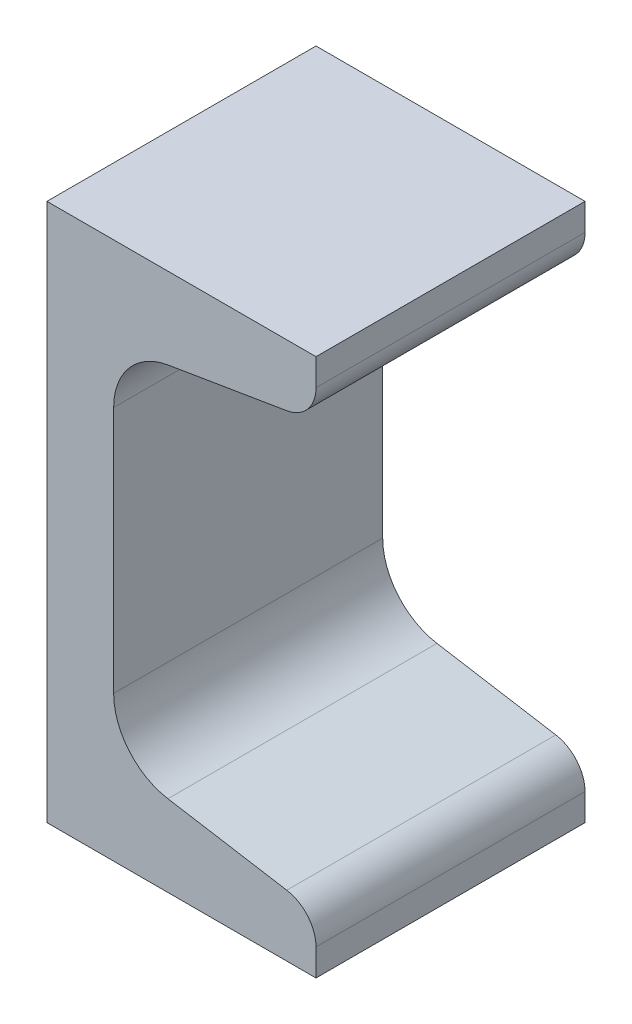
ISO-10303-21;
HEADER;
FILE_DESCRIPTION(('STEP AP214'),'2;1');
FILE_NAME('part.step','',(''),(''),'','','');
FILE_SCHEMA(('AUTOMOTIVE_DESIGN { 1 0 10303 214 1 1 1 1 }'));
ENDSEC;
DATA;
#1=APPLICATION_CONTEXT('core data for automotive mechanical design processes');
#2=APPLICATION_PROTOCOL_DEFINITION('international standard','automotive_design',2000,#1);
#3=PRODUCT_CONTEXT('',#1,'mechanical');
#4=PRODUCT('Part','Part','',(#3));
#5=PRODUCT_RELATED_PRODUCT_CATEGORY('part','',(#4));
#6=PRODUCT_DEFINITION_FORMATION('','',#4);
#7=PRODUCT_DEFINITION_CONTEXT('part definition',#1,'design');
#8=PRODUCT_DEFINITION('design','',#6,#7);
#9=PRODUCT_DEFINITION_SHAPE('','',#8);
#10=(LENGTH_UNIT() NAMED_UNIT(*) SI_UNIT(.MILLI.,.METRE.));
#11=(NAMED_UNIT(*) PLANE_ANGLE_UNIT() SI_UNIT($,.RADIAN.));
#12=(NAMED_UNIT(*) SI_UNIT($,.STERADIAN.) SOLID_ANGLE_UNIT());
#13=UNCERTAINTY_MEASURE_WITH_UNIT(LENGTH_MEASURE(1.E-05),#10,'distance_accuracy_value','');
#14=(GEOMETRIC_REPRESENTATION_CONTEXT(3) GLOBAL_UNCERTAINTY_ASSIGNED_CONTEXT((#13)) GLOBAL_UNIT_ASSIGNED_CONTEXT((#10,
#11,#12)) REPRESENTATION_CONTEXT('',''));
#15=CARTESIAN_POINT('',(0.,0.,0.));
#16=DIRECTION('',(0.,0.,1.));
#17=DIRECTION('',(1.,0.,0.));
#18=AXIS2_PLACEMENT_3D('',#15,#16,#17);
#19=CARTESIAN_POINT('',(0.,0.,12.7));
#20=DIRECTION('',(0.,1.,0.));
#21=DIRECTION('',(0.,0.,1.));
#22=AXIS2_PLACEMENT_3D('',#19,#20,#21);
#23=PLANE('',#22);
#24=DIRECTION('',(1.,0.,0.));
#25=VECTOR('',#24,1.);
#26=CARTESIAN_POINT('',(0.,0.,-12.7));
#27=LINE('',#26,#25);
#28=CARTESIAN_POINT('',(0.,0.,-12.7));
#29=VERTEX_POINT('',#28);
#30=CARTESIAN_POINT('',(25.4,0.,-12.7));
#31=VERTEX_POINT('',#30);
#32=EDGE_CURVE('E153',#29,#31,#27,.T.);
#33=ORIENTED_EDGE('',*,*,#32,.T.);
#34=DIRECTION('',(0.,0.,-1.));
#35=VECTOR('',#34,1.);
#36=CARTESIAN_POINT('',(25.4,0.,12.7));
#37=LINE('',#36,#35);
#38=CARTESIAN_POINT('',(25.4,0.,12.7));
#39=VERTEX_POINT('',#38);
#40=EDGE_CURVE('E11',#39,#31,#37,.T.);
#41=ORIENTED_EDGE('',*,*,#40,.F.);
#42=DIRECTION('',(1.,0.,0.));
#43=VECTOR('',#42,1.);
#44=CARTESIAN_POINT('',(0.,0.,12.7));
#45=LINE('',#44,#43);
#46=CARTESIAN_POINT('',(0.,0.,12.7));
#47=VERTEX_POINT('',#46);
#48=EDGE_CURVE('E183',#47,#39,#45,.T.);
#49=ORIENTED_EDGE('',*,*,#48,.F.);
#50=DIRECTION('',(0.,0.,-1.));
#51=VECTOR('',#50,1.);
#52=CARTESIAN_POINT('',(0.,0.,12.7));
#53=LINE('',#52,#51);
#54=EDGE_CURVE('E49',#47,#29,#53,.T.);
#55=ORIENTED_EDGE('',*,*,#54,.T.);
#56=EDGE_LOOP('',(#33,#41,#49,#55));
#57=FACE_BOUND('',#56,.T.);
#58=ADVANCED_FACE('F33',(#57),#23,.F.);
#59=CARTESIAN_POINT('',(25.4,0.,12.7));
#60=DIRECTION('',(-1.,0.,0.));
#61=DIRECTION('',(0.,0.,1.));
#62=AXIS2_PLACEMENT_3D('',#59,#60,#61);
#63=PLANE('',#62);
#64=DIRECTION('',(0.,1.,0.));
#65=VECTOR('',#64,1.);
#66=CARTESIAN_POINT('',(25.4,0.,-12.7));
#67=LINE('',#66,#65);
#68=CARTESIAN_POINT('',(25.4,2.54,-12.7));
#69=VERTEX_POINT('',#68);
#70=EDGE_CURVE('E155',#31,#69,#67,.T.);
#71=ORIENTED_EDGE('',*,*,#70,.T.);
#72=DIRECTION('',(0.,0.,-1.));
#73=VECTOR('',#72,1.);
#74=CARTESIAN_POINT('',(25.4,2.54,12.7));
#75=LINE('',#74,#73);
#76=CARTESIAN_POINT('',(25.4,2.54,12.7));
#77=VERTEX_POINT('',#76);
#78=EDGE_CURVE('E41',#77,#69,#75,.T.);
#79=ORIENTED_EDGE('',*,*,#78,.F.);
#80=DIRECTION('',(0.,1.,0.));
#81=VECTOR('',#80,1.);
#82=CARTESIAN_POINT('',(25.4,0.,12.7));
#83=LINE('',#82,#81);
#84=EDGE_CURVE('E99',#39,#77,#83,.T.);
#85=ORIENTED_EDGE('',*,*,#84,.F.);
#86=ORIENTED_EDGE('',*,*,#40,.T.);
#87=EDGE_LOOP('',(#71,#79,#85,#86));
#88=FACE_BOUND('',#87,.T.);
#89=ADVANCED_FACE('F245',(#88),#63,.F.);
#90=CARTESIAN_POINT('',(22.098,2.54,12.7));
#91=DIRECTION('',(0.,0.,-1.));
#92=DIRECTION('',(-1.,0.,0.));
#93=AXIS2_PLACEMENT_3D('',#90,#91,#92);
#94=CYLINDRICAL_SURFACE('',#93,3.30200000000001);
#95=CARTESIAN_POINT('',(22.098,2.54,-12.7));
#96=DIRECTION('',(0.,0.,1.));
#97=DIRECTION('',(1.,0.,0.));
#98=AXIS2_PLACEMENT_3D('',#95,#96,#97);
#99=CIRCLE('',#98,3.30200000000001);
#100=CARTESIAN_POINT('',(22.6408839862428,5.7970663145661,-12.7));
#101=VERTEX_POINT('',#100);
#102=EDGE_CURVE('E157',#69,#101,#99,.T.);
#103=ORIENTED_EDGE('',*,*,#102,.T.);
#104=DIRECTION('',(0.,0.,-1.));
#105=VECTOR('',#104,1.);
#106=CARTESIAN_POINT('',(22.6408839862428,5.7970663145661,12.7));
#107=LINE('',#106,#105);
#108=CARTESIAN_POINT('',(22.6408839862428,5.7970663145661,12.7));
#109=VERTEX_POINT('',#108);
#110=EDGE_CURVE('E198',#109,#101,#107,.T.);
#111=ORIENTED_EDGE('',*,*,#110,.F.);
#112=CARTESIAN_POINT('',(22.098,2.54,12.7));
#113=DIRECTION('',(0.,0.,1.));
#114=DIRECTION('',(1.,0.,0.));
#115=AXIS2_PLACEMENT_3D('',#112,#113,#114);
#116=CIRCLE('',#115,3.30200000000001);
#117=EDGE_CURVE('E205',#77,#109,#116,.T.);
#118=ORIENTED_EDGE('',*,*,#117,.F.);
#119=ORIENTED_EDGE('',*,*,#78,.T.);
#120=EDGE_LOOP('',(#103,#111,#118,#119));
#121=FACE_BOUND('',#120,.T.);
#122=ADVANCED_FACE('F203',(#121),#94,.T.);
#123=CARTESIAN_POINT('',(11.4196177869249,7.66741377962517,12.7));
#124=DIRECTION('',(0.16441065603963,0.986391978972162,0.));
#125=DIRECTION('',(-0.986391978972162,0.16441065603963,0.));
#126=AXIS2_PLACEMENT_3D('',#123,#124,#125);
#127=PLANE('',#126);
#128=DIRECTION('',(0.986391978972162,-0.16441065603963,0.));
#129=VECTOR('',#128,1.);
#130=CARTESIAN_POINT('',(11.4196177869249,7.66741377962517,-12.7));
#131=LINE('',#130,#129);
#132=CARTESIAN_POINT('',(11.4196177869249,7.66741377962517,-12.7));
#133=VERTEX_POINT('',#132);
#134=EDGE_CURVE('E160',#133,#101,#131,.T.);
#135=ORIENTED_EDGE('',*,*,#134,.F.);
#136=DIRECTION('',(0.,0.,-1.));
#137=VECTOR('',#136,1.);
#138=CARTESIAN_POINT('',(11.4196177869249,7.66741377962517,12.7));
#139=LINE('',#138,#137);
#140=CARTESIAN_POINT('',(11.4196177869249,7.66741377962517,12.7));
#141=VERTEX_POINT('',#140);
#142=EDGE_CURVE('E196',#141,#133,#139,.T.);
#143=ORIENTED_EDGE('',*,*,#142,.F.);
#144=DIRECTION('',(0.986391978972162,-0.16441065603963,0.));
#145=VECTOR('',#144,1.);
#146=CARTESIAN_POINT('',(11.4196177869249,7.66741377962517,12.7));
#147=LINE('',#146,#145);
#148=EDGE_CURVE('E214',#141,#109,#147,.T.);
#149=ORIENTED_EDGE('',*,*,#148,.T.);
#150=ORIENTED_EDGE('',*,*,#110,.T.);
#151=EDGE_LOOP('',(#135,#143,#149,#150));
#152=FACE_BOUND('',#151,.T.);
#153=ADVANCED_FACE('F211',(#152),#127,.T.);
#154=CARTESIAN_POINT('',(12.4276400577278,13.7151062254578,12.7));
#155=DIRECTION('',(0.,0.,-1.));
#156=DIRECTION('',(-1.,0.,0.));
#157=AXIS2_PLACEMENT_3D('',#154,#155,#156);
#158=CYLINDRICAL_SURFACE('',#157,6.13112492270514);
#159=CARTESIAN_POINT('',(12.4276400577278,13.7151062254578,-12.7));
#160=DIRECTION('',(0.,0.,1.));
#161=DIRECTION('',(1.,0.,0.));
#162=AXIS2_PLACEMENT_3D('',#159,#160,#161);
#163=CIRCLE('',#162,6.13112492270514);
#164=CARTESIAN_POINT('',(6.29651513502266,13.7151062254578,-12.7));
#165=VERTEX_POINT('',#164);
#166=EDGE_CURVE('E163',#165,#133,#163,.T.);
#167=ORIENTED_EDGE('',*,*,#166,.F.);
#168=DIRECTION('',(0.,0.,-1.));
#169=VECTOR('',#168,1.);
#170=CARTESIAN_POINT('',(6.29651513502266,13.7151062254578,12.7));
#171=LINE('',#170,#169);
#172=CARTESIAN_POINT('',(6.29651513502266,13.7151062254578,12.7));
#173=VERTEX_POINT('',#172);
#174=EDGE_CURVE('E194',#173,#165,#171,.T.);
#175=ORIENTED_EDGE('',*,*,#174,.F.);
#176=CARTESIAN_POINT('',(12.4276400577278,13.7151062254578,12.7));
#177=DIRECTION('',(0.,0.,1.));
#178=DIRECTION('',(1.,0.,0.));
#179=AXIS2_PLACEMENT_3D('',#176,#177,#178);
#180=CIRCLE('',#179,6.13112492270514);
#181=EDGE_CURVE('E217',#173,#141,#180,.T.);
#182=ORIENTED_EDGE('',*,*,#181,.T.);
#183=ORIENTED_EDGE('',*,*,#142,.T.);
#184=EDGE_LOOP('',(#167,#175,#182,#183));
#185=FACE_BOUND('',#184,.T.);
#186=ADVANCED_FACE('F258',(#185),#158,.F.);
#187=CARTESIAN_POINT('',(6.29651513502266,37.0848937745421,12.7));
#188=DIRECTION('',(1.,0.,0.));
#189=DIRECTION('',(0.,1.,0.));
#190=AXIS2_PLACEMENT_3D('',#187,#188,#189);
#191=PLANE('',#190);
#192=DIRECTION('',(0.,-1.,0.));
#193=VECTOR('',#192,1.);
#194=CARTESIAN_POINT('',(6.29651513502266,37.0848937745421,-12.7));
#195=LINE('',#194,#193);
#196=CARTESIAN_POINT('',(6.29651513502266,37.0848937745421,-12.7));
#197=VERTEX_POINT('',#196);
#198=EDGE_CURVE('E166',#197,#165,#195,.T.);
#199=ORIENTED_EDGE('',*,*,#198,.F.);
#200=DIRECTION('',(0.,0.,-1.));
#201=VECTOR('',#200,1.);
#202=CARTESIAN_POINT('',(6.29651513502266,37.0848937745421,12.7));
#203=LINE('',#202,#201);
#204=CARTESIAN_POINT('',(6.29651513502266,37.0848937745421,12.7));
#205=VERTEX_POINT('',#204);
#206=EDGE_CURVE('E192',#205,#197,#203,.T.);
#207=ORIENTED_EDGE('',*,*,#206,.F.);
#208=DIRECTION('',(0.,-1.,0.));
#209=VECTOR('',#208,1.);
#210=CARTESIAN_POINT('',(6.29651513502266,37.0848937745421,12.7));
#211=LINE('',#210,#209);
#212=EDGE_CURVE('E219',#205,#173,#211,.T.);
#213=ORIENTED_EDGE('',*,*,#212,.T.);
#214=ORIENTED_EDGE('',*,*,#174,.T.);
#215=EDGE_LOOP('',(#199,#207,#213,#214));
#216=FACE_BOUND('',#215,.T.);
#217=ADVANCED_FACE('F261',(#216),#191,.T.);
#218=CARTESIAN_POINT('',(12.4276400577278,37.0848937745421,12.7));
#219=DIRECTION('',(0.,0.,-1.));
#220=DIRECTION('',(-1.,0.,0.));
#221=AXIS2_PLACEMENT_3D('',#218,#219,#220);
#222=CYLINDRICAL_SURFACE('',#221,6.13112492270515);
#223=CARTESIAN_POINT('',(12.4276400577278,37.0848937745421,-12.7));
#224=DIRECTION('',(0.,0.,-1.));
#225=DIRECTION('',(-1.,0.,0.));
#226=AXIS2_PLACEMENT_3D('',#223,#224,#225);
#227=CIRCLE('',#226,6.13112492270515);
#228=CARTESIAN_POINT('',(11.4196177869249,43.1325862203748,-12.7));
#229=VERTEX_POINT('',#228);
#230=EDGE_CURVE('E169',#197,#229,#227,.T.);
#231=ORIENTED_EDGE('',*,*,#230,.T.);
#232=DIRECTION('',(0.,0.,-1.));
#233=VECTOR('',#232,1.);
#234=CARTESIAN_POINT('',(11.4196177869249,43.1325862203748,12.7));
#235=LINE('',#234,#233);
#236=CARTESIAN_POINT('',(11.4196177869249,43.1325862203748,12.7));
#237=VERTEX_POINT('',#236);
#238=EDGE_CURVE('E189',#237,#229,#235,.T.);
#239=ORIENTED_EDGE('',*,*,#238,.F.);
#240=CARTESIAN_POINT('',(12.4276400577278,37.0848937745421,12.7));
#241=DIRECTION('',(0.,0.,-1.));
#242=DIRECTION('',(-1.,0.,0.));
#243=AXIS2_PLACEMENT_3D('',#240,#241,#242);
#244=CIRCLE('',#243,6.13112492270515);
#245=EDGE_CURVE('E226',#205,#237,#244,.T.);
#246=ORIENTED_EDGE('',*,*,#245,.F.);
#247=ORIENTED_EDGE('',*,*,#206,.T.);
#248=EDGE_LOOP('',(#231,#239,#246,#247));
#249=FACE_BOUND('',#248,.T.);
#250=ADVANCED_FACE('F265',(#249),#222,.F.);
#251=CARTESIAN_POINT('',(11.4196177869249,43.1325862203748,12.7));
#252=DIRECTION('',(-0.16441065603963,0.986391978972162,0.));
#253=DIRECTION('',(-0.986391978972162,-0.16441065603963,0.));
#254=AXIS2_PLACEMENT_3D('',#251,#252,#253);
#255=PLANE('',#254);
#256=DIRECTION('',(0.986391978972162,0.16441065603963,0.));
#257=VECTOR('',#256,1.);
#258=CARTESIAN_POINT('',(11.4196177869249,43.1325862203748,-12.7));
#259=LINE('',#258,#257);
#260=CARTESIAN_POINT('',(22.6408839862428,45.0029336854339,-12.7));
#261=VERTEX_POINT('',#260);
#262=EDGE_CURVE('E171',#229,#261,#259,.T.);
#263=ORIENTED_EDGE('',*,*,#262,.T.);
#264=DIRECTION('',(0.,0.,-1.));
#265=VECTOR('',#264,1.);
#266=CARTESIAN_POINT('',(22.6408839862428,45.0029336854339,12.7));
#267=LINE('',#266,#265);
#268=CARTESIAN_POINT('',(22.6408839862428,45.0029336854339,12.7));
#269=VERTEX_POINT('',#268);
#270=EDGE_CURVE('E187',#269,#261,#267,.T.);
#271=ORIENTED_EDGE('',*,*,#270,.F.);
#272=DIRECTION('',(0.986391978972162,0.16441065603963,0.));
#273=VECTOR('',#272,1.);
#274=CARTESIAN_POINT('',(11.4196177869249,43.1325862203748,12.7));
#275=LINE('',#274,#273);
#276=EDGE_CURVE('E228',#237,#269,#275,.T.);
#277=ORIENTED_EDGE('',*,*,#276,.F.);
#278=ORIENTED_EDGE('',*,*,#238,.T.);
#279=EDGE_LOOP('',(#263,#271,#277,#278));
#280=FACE_BOUND('',#279,.T.);
#281=ADVANCED_FACE('F269',(#280),#255,.F.);
#282=CARTESIAN_POINT('',(22.098,48.26,12.7));
#283=DIRECTION('',(0.,0.,-1.));
#284=DIRECTION('',(-1.,0.,0.));
#285=AXIS2_PLACEMENT_3D('',#282,#283,#284);
#286=CYLINDRICAL_SURFACE('',#285,3.30200000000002);
#287=CARTESIAN_POINT('',(22.098,48.26,-12.7));
#288=DIRECTION('',(0.,0.,-1.));
#289=DIRECTION('',(-1.,0.,0.));
#290=AXIS2_PLACEMENT_3D('',#287,#288,#289);
#291=CIRCLE('',#290,3.30200000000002);
#292=CARTESIAN_POINT('',(25.4,48.26,-12.7));
#293=VERTEX_POINT('',#292);
#294=EDGE_CURVE('E174',#293,#261,#291,.T.);
#295=ORIENTED_EDGE('',*,*,#294,.F.);
#296=DIRECTION('',(0.,0.,-1.));
#297=VECTOR('',#296,1.);
#298=CARTESIAN_POINT('',(25.4,48.26,12.7));
#299=LINE('',#298,#297);
#300=CARTESIAN_POINT('',(25.4,48.26,12.7));
#301=VERTEX_POINT('',#300);
#302=EDGE_CURVE('E136',#301,#293,#299,.T.);
#303=ORIENTED_EDGE('',*,*,#302,.F.);
#304=CARTESIAN_POINT('',(22.098,48.26,12.7));
#305=DIRECTION('',(0.,0.,-1.));
#306=DIRECTION('',(-1.,0.,0.));
#307=AXIS2_PLACEMENT_3D('',#304,#305,#306);
#308=CIRCLE('',#307,3.30200000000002);
#309=EDGE_CURVE('E145',#301,#269,#308,.T.);
#310=ORIENTED_EDGE('',*,*,#309,.T.);
#311=ORIENTED_EDGE('',*,*,#270,.T.);
#312=EDGE_LOOP('',(#295,#303,#310,#311));
#313=FACE_BOUND('',#312,.T.);
#314=ADVANCED_FACE('F231',(#313),#286,.T.);
#315=CARTESIAN_POINT('',(25.4,50.8,12.7));
#316=DIRECTION('',(1.,0.,0.));
#317=DIRECTION('',(0.,1.,0.));
#318=AXIS2_PLACEMENT_3D('',#315,#316,#317);
#319=PLANE('',#318);
#320=DIRECTION('',(0.,-1.,0.));
#321=VECTOR('',#320,1.);
#322=CARTESIAN_POINT('',(25.4,50.8,-12.7));
#323=LINE('',#322,#321);
#324=CARTESIAN_POINT('',(25.4,50.8,-12.7));
#325=VERTEX_POINT('',#324);
#326=EDGE_CURVE('E132',#325,#293,#323,.T.);
#327=ORIENTED_EDGE('',*,*,#326,.F.);
#328=DIRECTION('',(0.,0.,-1.));
#329=VECTOR('',#328,1.);
#330=CARTESIAN_POINT('',(25.4,50.8,12.7));
#331=LINE('',#330,#329);
#332=CARTESIAN_POINT('',(25.4,50.8,12.7));
#333=VERTEX_POINT('',#332);
#334=EDGE_CURVE('E127',#333,#325,#331,.T.);
#335=ORIENTED_EDGE('',*,*,#334,.F.);
#336=DIRECTION('',(0.,-1.,0.));
#337=VECTOR('',#336,1.);
#338=CARTESIAN_POINT('',(25.4,50.8,12.7));
#339=LINE('',#338,#337);
#340=EDGE_CURVE('E130',#333,#301,#339,.T.);
#341=ORIENTED_EDGE('',*,*,#340,.T.);
#342=ORIENTED_EDGE('',*,*,#302,.T.);
#343=EDGE_LOOP('',(#327,#335,#341,#342));
#344=FACE_BOUND('',#343,.T.);
#345=ADVANCED_FACE('F129',(#344),#319,.T.);
#346=CARTESIAN_POINT('',(0.,50.8,12.7));
#347=DIRECTION('',(0.,1.,0.));
#348=DIRECTION('',(0.,0.,1.));
#349=AXIS2_PLACEMENT_3D('',#346,#347,#348);
#350=PLANE('',#349);
#351=DIRECTION('',(1.,0.,0.));
#352=VECTOR('',#351,1.);
#353=CARTESIAN_POINT('',(0.,50.8,-12.7));
#354=LINE('',#353,#352);
#355=CARTESIAN_POINT('',(0.,50.8,-12.7));
#356=VERTEX_POINT('',#355);
#357=EDGE_CURVE('E178',#356,#325,#354,.T.);
#358=ORIENTED_EDGE('',*,*,#357,.F.);
#359=DIRECTION('',(0.,0.,-1.));
#360=VECTOR('',#359,1.);
#361=CARTESIAN_POINT('',(0.,50.8,12.7));
#362=LINE('',#361,#360);
#363=CARTESIAN_POINT('',(0.,50.8,12.7));
#364=VERTEX_POINT('',#363);
#365=EDGE_CURVE('E87',#364,#356,#362,.T.);
#366=ORIENTED_EDGE('',*,*,#365,.F.);
#367=DIRECTION('',(1.,0.,0.));
#368=VECTOR('',#367,1.);
#369=CARTESIAN_POINT('',(0.,50.8,12.7));
#370=LINE('',#369,#368);
#371=EDGE_CURVE('E143',#364,#333,#370,.T.);
#372=ORIENTED_EDGE('',*,*,#371,.T.);
#373=ORIENTED_EDGE('',*,*,#334,.T.);
#374=EDGE_LOOP('',(#358,#366,#372,#373));
#375=FACE_BOUND('',#374,.T.);
#376=ADVANCED_FACE('F147',(#375),#350,.T.);
#377=CARTESIAN_POINT('',(0.,0.,12.7));
#378=DIRECTION('',(-1.,0.,0.));
#379=DIRECTION('',(0.,0.,1.));
#380=AXIS2_PLACEMENT_3D('',#377,#378,#379);
#381=PLANE('',#380);
#382=DIRECTION('',(0.,1.,0.));
#383=VECTOR('',#382,1.);
#384=CARTESIAN_POINT('',(0.,0.,-12.7));
#385=LINE('',#384,#383);
#386=EDGE_CURVE('E180',#29,#356,#385,.T.);
#387=ORIENTED_EDGE('',*,*,#386,.F.);
#388=ORIENTED_EDGE('',*,*,#54,.F.);
#389=DIRECTION('',(0.,1.,0.));
#390=VECTOR('',#389,1.);
#391=CARTESIAN_POINT('',(0.,0.,12.7));
#392=LINE('',#391,#390);
#393=EDGE_CURVE('E148',#47,#364,#392,.T.);
#394=ORIENTED_EDGE('',*,*,#393,.T.);
#395=ORIENTED_EDGE('',*,*,#365,.T.);
#396=EDGE_LOOP('',(#387,#388,#394,#395));
#397=FACE_BOUND('',#396,.T.);
#398=ADVANCED_FACE('F234',(#397),#381,.T.);
#399=CARTESIAN_POINT('',(22.098,2.54,12.7));
#400=DIRECTION('',(0.,0.,1.));
#401=DIRECTION('',(1.,0.,0.));
#402=AXIS2_PLACEMENT_3D('',#399,#400,#401);
#403=PLANE('',#402);
#404=ORIENTED_EDGE('',*,*,#48,.T.);
#405=ORIENTED_EDGE('',*,*,#84,.T.);
#406=ORIENTED_EDGE('',*,*,#117,.T.);
#407=ORIENTED_EDGE('',*,*,#148,.F.);
#408=ORIENTED_EDGE('',*,*,#181,.F.);
#409=ORIENTED_EDGE('',*,*,#212,.F.);
#410=ORIENTED_EDGE('',*,*,#245,.T.);
#411=ORIENTED_EDGE('',*,*,#276,.T.);
#412=ORIENTED_EDGE('',*,*,#309,.F.);
#413=ORIENTED_EDGE('',*,*,#340,.F.);
#414=ORIENTED_EDGE('',*,*,#371,.F.);
#415=ORIENTED_EDGE('',*,*,#393,.F.);
#416=EDGE_LOOP('',(#404,#405,#406,#407,#408,#409,#410,#411,#412,#413,#414,#415));
#417=FACE_BOUND('',#416,.T.);
#418=ADVANCED_FACE('F141',(#417),#403,.T.);
#419=CARTESIAN_POINT('',(22.098,2.54,-12.7));
#420=DIRECTION('',(0.,0.,1.));
#421=DIRECTION('',(1.,0.,0.));
#422=AXIS2_PLACEMENT_3D('',#419,#420,#421);
#423=PLANE('',#422);
#424=ORIENTED_EDGE('',*,*,#32,.F.);
#425=ORIENTED_EDGE('',*,*,#386,.T.);
#426=ORIENTED_EDGE('',*,*,#357,.T.);
#427=ORIENTED_EDGE('',*,*,#326,.T.);
#428=ORIENTED_EDGE('',*,*,#294,.T.);
#429=ORIENTED_EDGE('',*,*,#262,.F.);
#430=ORIENTED_EDGE('',*,*,#230,.F.);
#431=ORIENTED_EDGE('',*,*,#198,.T.);
#432=ORIENTED_EDGE('',*,*,#166,.T.);
#433=ORIENTED_EDGE('',*,*,#134,.T.);
#434=ORIENTED_EDGE('',*,*,#102,.F.);
#435=ORIENTED_EDGE('',*,*,#70,.F.);
#436=EDGE_LOOP('',(#424,#425,#426,#427,#428,#429,#430,#431,#432,#433,#434,#435));
#437=FACE_BOUND('',#436,.T.);
#438=ADVANCED_FACE('F207',(#437),#423,.F.);
#439=CLOSED_SHELL('',(#58,#89,#122,#153,#186,#217,#250,#281,#314,#345,#376,#398,#418,#438));
#440=MANIFOLD_SOLID_BREP('B2',#439);
#441=ADVANCED_BREP_SHAPE_REPRESENTATION('',(#18,#440),#14);
#442=SHAPE_DEFINITION_REPRESENTATION(#9,#441);
ENDSEC;
END-ISO-10303-21;
